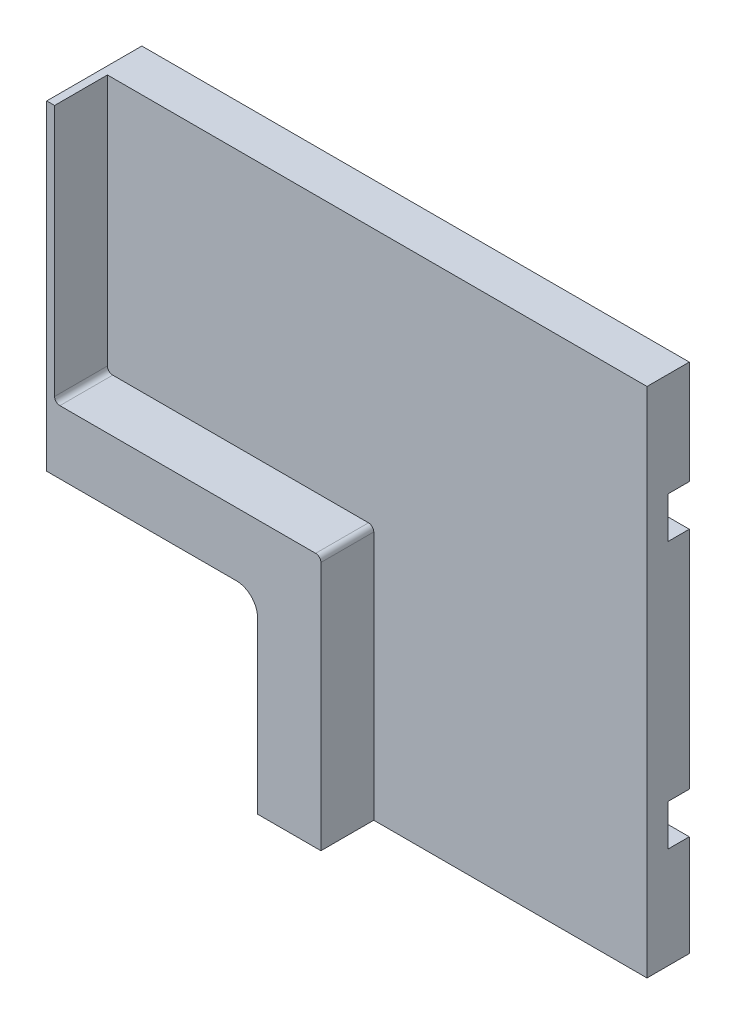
from build123d import *

# Parameters (mm, degrees)
AUFSATZ_LINEAR_AUSTRAGEN1_DEPTH = 9
AUFSATZ_LINEAR_AUSTRAGEN2_DEPTH = 9
SCHNITT_LINEAR_START            = 4
SCHNITT_LINEAR_AUSTRAGEN1_DEPTH = 5
AUFSATZ_LINEAR_AUSTRAGEN4_DEPTH = 5
VERRUNDUNG1_R                   = 0.5
SKIZZE5_W                       = 2.5
SKIZZE5_H                       = 5.6
SCHNITT_LINEAR_AUSTRAGEN2_DEPTH = 7.7
SKIZZE6_R                       = 1.9
SCHNITT_LINEAR_AUSTRAGEN3_DEPTH = 4.65
SCHNITT_LINEAR_AUSTRAGEN4_DEPTH = 3.6
SCHNITT_LINEAR_AUSTRAGEN5_DEPTH = 2
VERRUNDUNG2_R                   = 2
SKIZZE10_OUTSIDE_W              = 211.396
SKIZZE10_OUTSIDE_H              = 211.396
SKIZZE10_OUTSIDE_W_2            = 51.792978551
SKIZZE10_OUTSIDE_H_2            = 48.466823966
SCHNITT_LINEAR_AUSTRAGEN7_DEPTH = 10


with BuildPart() as part:
    # Skizze1 → Aufsatz-Linear austragen1 (new body)
    with BuildSketch(Plane.XY):
        Polygon((-75.6, 50.4), (-75.6, -50.4), (-50.4, -50.4), (-50.4, -75.6), (50.4, -75.6), (50.4, -50.4), (75.6, -50.4), (75.6, 50.4), (50.4, 50.4), (50.4, 75.6), (-50.4, 75.6), (-50.4, 50.4), align=None)
    extrude(amount=AUFSATZ_LINEAR_AUSTRAGEN1_DEPTH)

    # Skizze3 → Aufsatz-Linear austragen2 (add)
    with BuildSketch(Plane.XY.offset(9)):
        Polygon((56.4, 56.4), (56.4, 81.6), (-56.4, 81.6), (-56.4, 56.4), (-81.6, 56.4), (-81.6, -56.4), (-56.4, -56.4), (-56.4, -81.6), (56.4, -81.6), (56.4, -56.4), (81.6, -56.4), (81.6, 56.4), align=None)
    extrude(amount=-AUFSATZ_LINEAR_AUSTRAGEN2_DEPTH)

    # Skizze1_4 → Schnitt-Linear austragen1 (cut)
    with BuildSketch(Plane.XY.offset(SCHNITT_LINEAR_START)):
        Polygon((-75.6, 50.4), (-75.6, -50.4), (-50.4, -50.4), (-50.4, -75.6), (50.4, -75.6), (50.4, -50.4), (75.6, -50.4), (75.6, 50.4), (50.4, 50.4), (50.4, 75.6), (-50.4, 75.6), (-50.4, 50.4), align=None)
    extrude(amount=SCHNITT_LINEAR_AUSTRAGEN1_DEPTH, mode=Mode.SUBTRACT)

    # Skizze4 → Aufsatz-Linear austragen4 (add)
    with BuildSketch(Plane.XY.offset(4)):
        with BuildLine():
            Line((-25.2, 0), (-25.2, -25.2))
            Line((-25.2, -25.2), (0, -25.2))
            Line((0, -25.2), (0, -0.5))
            ThreePointArc((0, -0.5), (0.146446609, -0.146446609), (0.5, 0))
            Line((0.5, 0), (25.2, 0))
            Line((25.2, 0), (25.2, 25.2))
            Line((25.2, 25.2), (0, 25.2))
            Line((0, 25.2), (0, 0.5))
            ThreePointArc((0, 0.5), (-0.146446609, 0.146446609), (-0.5, 0))
            Line((-0.5, 0), (-25.2, 0))
        make_face()
    extrude(amount=AUFSATZ_LINEAR_AUSTRAGEN4_DEPTH)

    # Verrundung1
    verrundung1_edges = [part.edges().sort_by_distance(p)[0] for p in [
        (-25.2, 0, 6.5),
        (-25.2, -25.2, 6.5),
        (0, -25.2, 6.5),
        (25.2, 0, 6.5),
        (25.2, 25.2, 6.5),
        (0, 25.2, 6.5),
        (-50.4, 50.4, 6.5),
        (-75.6, 50.4, 6.5),
        (-75.6, -50.4, 6.5),
        (-50.4, -50.4, 6.5),
        (-50.4, -75.6, 6.5),
        (50.4, -75.6, 6.5),
        (50.4, -50.4, 6.5),
        (75.6, -50.4, 6.5),
        (75.6, 50.4, 6.5),
        (50.4, 50.4, 6.5),
        (50.4, 75.6, 6.5),
        (-50.4, 75.6, 6.5),
    ]]
    fillet(verrundung1_edges, radius=VERRUNDUNG1_R)

    # Skizze5 → Schnitt-Linear austragen2 (cut)
    with BuildSketch(Plane(origin=(0, 0, 0), x_dir=(-1, 0, 0), z_dir=(0, 0, -1))):
        with Locations((-78.9, 30)):
            Rectangle(SKIZZE5_W, SKIZZE5_H)
        with Locations((-78.9, -30)):
            Rectangle(SKIZZE5_W, SKIZZE5_H)
    schnitt_linear_austragen2 = extrude(amount=-SCHNITT_LINEAR_AUSTRAGEN2_DEPTH, mode=Mode.SUBTRACT)

    # Skizze6 → Schnitt-Linear austragen3 (cut)
    with BuildSketch(Plane(origin=(81.6, 0, 0), x_dir=(0, 0, -1), z_dir=(1, 0, 0))):
        with Locations((-4.5, 30)):
            Circle(SKIZZE6_R)
        with Locations((-4.5, -30)):
            Circle(SKIZZE6_R)
    schnitt_linear_austragen3 = extrude(amount=-SCHNITT_LINEAR_AUSTRAGEN3_DEPTH, mode=Mode.SUBTRACT)

    # Spiegeln2: Schnitt-Linear austragen2, Schnitt-Linear austragen3 across plane
    add(schnitt_linear_austragen2.mirror(Plane(origin=(0, 0, 0), x_dir=(0, 0, 1), z_dir=(1, 0, 0))), mode=Mode.SUBTRACT)
    add(schnitt_linear_austragen3.mirror(Plane(origin=(0, 0, 0), x_dir=(0, 0, 1), z_dir=(1, 0, 0))), mode=Mode.SUBTRACT)

    # Skizze7 → Schnitt-Linear austragen4 (cut)
    with BuildSketch(Plane(origin=(0, 0, 0), x_dir=(-1, 0, 0), z_dir=(0, 0, -1))):
        Polygon((-39.55, 65.15), (-39.55, 60.85), (-36.05, 60.85), (-36.05, 61.05), (-34.25, 61.05), (-34.25, 64.95), (-36.05, 64.95), (-36.05, 65.15), align=None)
        Polygon((-64.75, 39.95), (-64.75, 35.65), (-61.25, 35.65), (-61.25, 35.85), (-59.45, 35.85), (-59.45, 39.75), (-61.25, 39.75), (-61.25, 39.95), align=None)
        Polygon((-14.35, -10.45), (-14.35, -14.75), (-10.85, -14.75), (-10.85, -14.55), (-9.05, -14.55), (-9.05, -10.65), (-10.85, -10.65), (-10.85, -10.45), align=None)
        Polygon((14.35, 14.75), (14.35, 10.45), (10.85, 10.45), (10.85, 10.65), (9.05, 10.65), (9.05, 14.55), (10.85, 14.55), (10.85, 14.75), align=None)
        Polygon((64.75, -35.65), (64.75, -39.95), (61.25, -39.95), (61.25, -39.75), (59.45, -39.75), (59.45, -35.85), (61.25, -35.85), (61.25, -35.65), align=None)
        Polygon((39.55, -60.85), (39.55, -65.15), (36.05, -65.15), (36.05, -64.95), (34.25, -64.95), (34.25, -61.05), (36.05, -61.05), (36.05, -60.85), align=None)
    extrude(amount=-SCHNITT_LINEAR_AUSTRAGEN4_DEPTH, mode=Mode.SUBTRACT)

    # Skizze9 → Schnitt-Linear austragen5 (cut)
    with BuildSketch(Plane(origin=(0, 0, 0), x_dir=(-1, 0, 0), z_dir=(0, 0, -1))):
        Polygon((-1.95, 64.95), (1.95, 64.95), (1.95, 14.55), (9.05, 14.55), (9.05, 10.65), (1.95, 10.65), (1.95, -35.85), (59.45, -35.85), (59.45, -39.75), (1.95, -39.75), (1.95, -61.05), (34.25, -61.05), (34.25, -64.95), (1.95, -64.95), (-1.95, -64.95), (-1.95, -14.55), (-9.05, -14.55), (-9.05, -10.65), (-1.95, -10.65), (-1.95, 35.85), (-59.45, 35.85), (-59.45, 39.75), (-1.95, 39.75), (-1.95, 61.05), (-34.25, 61.05), (-34.25, 64.95), align=None)
    extrude(amount=-SCHNITT_LINEAR_AUSTRAGEN5_DEPTH, mode=Mode.SUBTRACT)

    # Verrundung2
    verrundung2_edges = [part.edges().sort_by_distance(p)[0] for p in [
        (56.4, 56.4, 4.5),
        (81.6, 56.4, 4.5),
        (81.6, -56.4, 4.5),
        (56.4, -56.4, 4.5),
        (56.4, -81.6, 4.5),
        (-56.4, -81.6, 4.5),
        (-56.4, -56.4, 4.5),
        (-81.6, -56.4, 4.5),
        (-81.6, 56.4, 4.5),
        (-56.4, 56.4, 4.5),
        (-56.4, 81.6, 4.5),
        (56.4, 81.6, 4.5),
    ]]
    fillet(verrundung2_edges, radius=VERRUNDUNG2_R)

    # Skizze10 outside → Schnitt-Linear austragen7 (cut)
    with BuildSketch(Plane(origin=(0, 0, 0), x_dir=(-1, 0, 0), z_dir=(0, 0, -1))):
        Rectangle(SKIZZE10_OUTSIDE_W, SKIZZE10_OUTSIDE_H)
        with Locations((50.446677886, -50.288289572)):
            Rectangle(SKIZZE10_OUTSIDE_W_2, SKIZZE10_OUTSIDE_H_2, mode=Mode.SUBTRACT)
    extrude(amount=-SCHNITT_LINEAR_AUSTRAGEN7_DEPTH, mode=Mode.SUBTRACT)


solid = part.part
